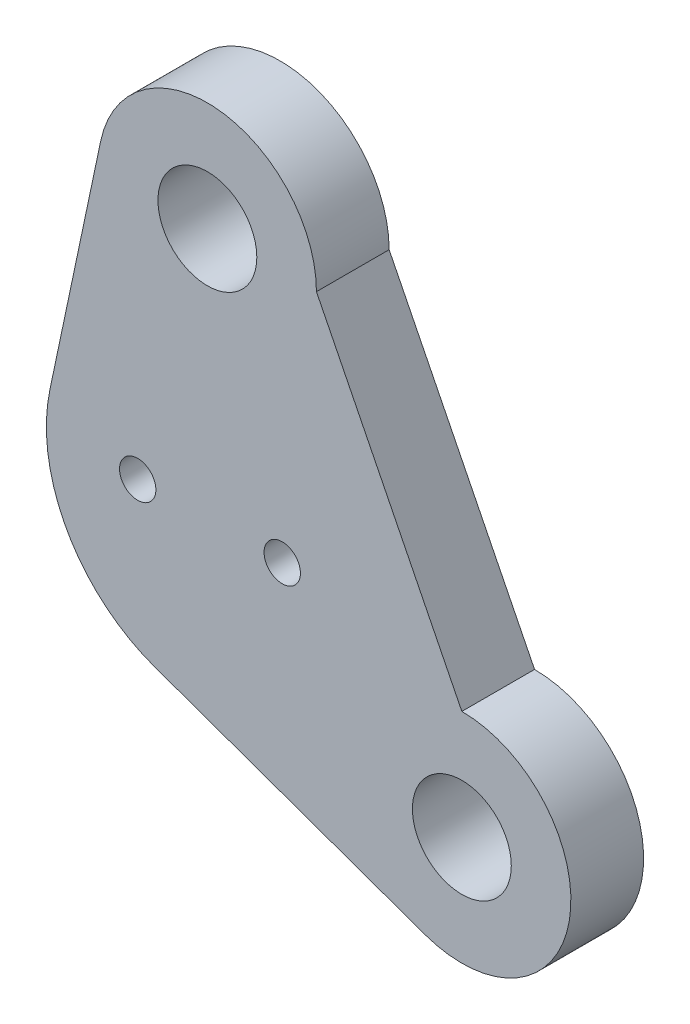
from build123d import *

# Parameters (mm, degrees)
BOSS_EXTRUDE1_DEPTH       = 2.54
F_4_CLEARANCE_HOLE1_D     = 3.4544
F_4_CLEARANCE_HOLE1_DEPTH = 6.35
F_4_CLEARANCE_HOLE1_TIP   = 1.037806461
SKETCH4_R                 = 0.635
CUT_EXTRUDE1_DEPTH        = 44.987650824


with BuildPart() as part:
    # Sketch1 → Boss-Extrude1 (new body)
    with BuildSketch(Plane.XY):
        with BuildLine():
            Line((-31.75, 2.54), (-26.67, -7.62))
            ThreePointArc((-26.67, -7.62), (-22.916032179, -12.081018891), (-27.952889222, -15.017519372))
            Line((-27.952889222, -15.017519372), (-37.394333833, -11.641279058))
            ThreePointArc((-37.394333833, -11.641279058), (-40.45856785, -9.048443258), (-41.061858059, -5.080021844))
            Line((-41.061858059, -5.080021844), (-39.287905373, 3.326652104))
            ThreePointArc((-39.287905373, 3.326652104), (-35.164537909, 6.329420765), (-31.75, 2.54))
        make_face()
    extrude(amount=BOSS_EXTRUDE1_DEPTH)

    # 4 Clearance Hole1
    with Locations(Plane.XY.offset(2.54)):
        with Locations((-26.67, -11.43), (-35.56, 2.54)):
            Hole(F_4_CLEARANCE_HOLE1_D / 2, depth=F_4_CLEARANCE_HOLE1_DEPTH)
            with Locations((0, 0, -(F_4_CLEARANCE_HOLE1_DEPTH + F_4_CLEARANCE_HOLE1_TIP / 2))):  # 118° drill point
                Cone(0, F_4_CLEARANCE_HOLE1_D / 2, F_4_CLEARANCE_HOLE1_TIP, mode=Mode.SUBTRACT)

    # Sketch4 → Cut-Extrude1 (cut, through all)
    with BuildSketch(Plane.XY.offset(2.54)):
        with Locations((-32.945, -6.26)):
            Circle(SKETCH4_R)
        with Locations((-37.995, -6.26)):
            Circle(SKETCH4_R)
    extrude(amount=-CUT_EXTRUDE1_DEPTH, mode=Mode.SUBTRACT)


solid = part.part
